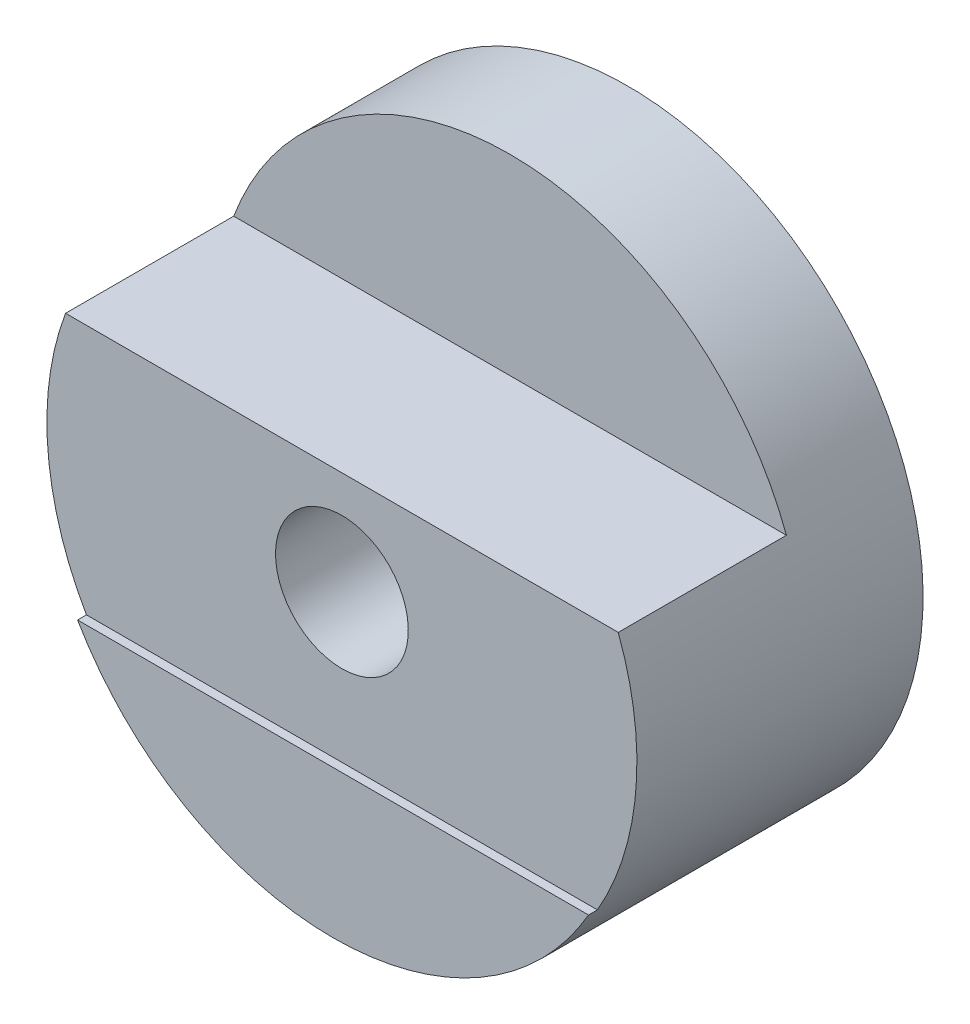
ISO-10303-21;
HEADER;
FILE_DESCRIPTION(('STEP AP214'),'2;1');
FILE_NAME('part.step','',(''),(''),'','','');
FILE_SCHEMA(('AUTOMOTIVE_DESIGN { 1 0 10303 214 1 1 1 1 }'));
ENDSEC;
DATA;
#1=APPLICATION_CONTEXT('core data for automotive mechanical design processes');
#2=APPLICATION_PROTOCOL_DEFINITION('international standard','automotive_design',2000,#1);
#3=PRODUCT_CONTEXT('',#1,'mechanical');
#4=PRODUCT('Part','Part','',(#3));
#5=PRODUCT_RELATED_PRODUCT_CATEGORY('part','',(#4));
#6=PRODUCT_DEFINITION_FORMATION('','',#4);
#7=PRODUCT_DEFINITION_CONTEXT('part definition',#1,'design');
#8=PRODUCT_DEFINITION('design','',#6,#7);
#9=PRODUCT_DEFINITION_SHAPE('','',#8);
#10=(LENGTH_UNIT() NAMED_UNIT(*) SI_UNIT(.MILLI.,.METRE.));
#11=(NAMED_UNIT(*) PLANE_ANGLE_UNIT() SI_UNIT($,.RADIAN.));
#12=(NAMED_UNIT(*) SI_UNIT($,.STERADIAN.) SOLID_ANGLE_UNIT());
#13=UNCERTAINTY_MEASURE_WITH_UNIT(LENGTH_MEASURE(1.E-05),#10,'distance_accuracy_value','');
#14=(GEOMETRIC_REPRESENTATION_CONTEXT(3) GLOBAL_UNCERTAINTY_ASSIGNED_CONTEXT((#13)) GLOBAL_UNIT_ASSIGNED_CONTEXT((#10,
#11,#12)) REPRESENTATION_CONTEXT('',''));
#15=CARTESIAN_POINT('',(0.,0.,0.));
#16=DIRECTION('',(0.,0.,1.));
#17=DIRECTION('',(1.,0.,0.));
#18=AXIS2_PLACEMENT_3D('',#15,#16,#17);
#19=CARTESIAN_POINT('',(0.,0.,-10.));
#20=DIRECTION('',(0.,0.,1.));
#21=DIRECTION('',(0.,-1.,0.));
#22=AXIS2_PLACEMENT_3D('',#19,#20,#21);
#23=CYLINDRICAL_SURFACE('',#22,2.25);
#24=CARTESIAN_POINT('',(0.,0.,-0.3));
#25=DIRECTION('',(0.,0.,1.));
#26=DIRECTION('',(0.,-1.,0.));
#27=AXIS2_PLACEMENT_3D('',#24,#25,#26);
#28=CIRCLE('',#27,2.25);
#29=CARTESIAN_POINT('',(0.,-2.25,-0.300000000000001));
#30=VERTEX_POINT('',#29);
#31=EDGE_CURVE('E83',#30,#30,#28,.T.);
#32=ORIENTED_EDGE('',*,*,#31,.T.);
#33=EDGE_LOOP('',(#32));
#34=FACE_BOUND('',#33,.T.);
#35=CARTESIAN_POINT('',(0.,0.,-10.));
#36=DIRECTION('',(0.,0.,1.));
#37=DIRECTION('',(0.,-1.,0.));
#38=AXIS2_PLACEMENT_3D('',#35,#36,#37);
#39=CIRCLE('',#38,2.25);
#40=CARTESIAN_POINT('',(0.,-2.25,-10.));
#41=VERTEX_POINT('',#40);
#42=EDGE_CURVE('E69',#41,#41,#39,.T.);
#43=ORIENTED_EDGE('',*,*,#42,.F.);
#44=EDGE_LOOP('',(#43));
#45=FACE_BOUND('',#44,.T.);
#46=ADVANCED_FACE('F17',(#34,#45),#23,.F.);
#47=CARTESIAN_POINT('',(9.36749699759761,3.5,-6.));
#48=DIRECTION('',(0.,0.,-1.));
#49=DIRECTION('',(-1.,0.,0.));
#50=AXIS2_PLACEMENT_3D('',#47,#48,#49);
#51=PLANE('',#50);
#52=CARTESIAN_POINT('',(0.,0.,-6.));
#53=DIRECTION('',(0.,0.,1.));
#54=DIRECTION('',(0.,-1.,0.));
#55=AXIS2_PLACEMENT_3D('',#52,#53,#54);
#56=CIRCLE('',#55,10.);
#57=CARTESIAN_POINT('',(9.3674969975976,3.5,-6.00000000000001));
#58=VERTEX_POINT('',#57);
#59=CARTESIAN_POINT('',(-9.36749699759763,3.49999999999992,-6.));
#60=VERTEX_POINT('',#59);
#61=EDGE_CURVE('E55',#58,#60,#56,.T.);
#62=ORIENTED_EDGE('',*,*,#61,.T.);
#63=DIRECTION('',(1.,0.,0.));
#64=VECTOR('',#63,1.);
#65=CARTESIAN_POINT('',(0.,3.5,-6.00000000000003));
#66=LINE('',#65,#64);
#67=EDGE_CURVE('E58',#60,#58,#66,.T.);
#68=ORIENTED_EDGE('',*,*,#67,.T.);
#69=EDGE_LOOP('',(#62,#68));
#70=FACE_BOUND('',#69,.T.);
#71=ADVANCED_FACE('F57',(#70),#51,.F.);
#72=CARTESIAN_POINT('',(-9.36749699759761,3.5,-0.3));
#73=DIRECTION('',(0.,-1.,0.));
#74=DIRECTION('',(0.,0.,-1.));
#75=AXIS2_PLACEMENT_3D('',#72,#73,#74);
#76=PLANE('',#75);
#77=ORIENTED_EDGE('',*,*,#67,.F.);
#78=DIRECTION('',(0.,0.,1.));
#79=VECTOR('',#78,1.);
#80=CARTESIAN_POINT('',(-9.36749699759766,3.49999999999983,-5.));
#81=LINE('',#80,#79);
#82=CARTESIAN_POINT('',(-9.36749699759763,3.49999999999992,-0.3));
#83=VERTEX_POINT('',#82);
#84=EDGE_CURVE('E62',#60,#83,#81,.T.);
#85=ORIENTED_EDGE('',*,*,#84,.T.);
#86=DIRECTION('',(1.,0.,0.));
#87=VECTOR('',#86,1.);
#88=CARTESIAN_POINT('',(-0.508865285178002,3.5,-0.3));
#89=LINE('',#88,#87);
#90=CARTESIAN_POINT('',(9.3674969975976,3.5,-0.3));
#91=VERTEX_POINT('',#90);
#92=EDGE_CURVE('E96',#83,#91,#89,.T.);
#93=ORIENTED_EDGE('',*,*,#92,.T.);
#94=DIRECTION('',(0.,0.,-1.));
#95=VECTOR('',#94,1.);
#96=CARTESIAN_POINT('',(9.3674969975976,3.5,-5.));
#97=LINE('',#96,#95);
#98=EDGE_CURVE('E63',#91,#58,#97,.T.);
#99=ORIENTED_EDGE('',*,*,#98,.T.);
#100=EDGE_LOOP('',(#77,#85,#93,#99));
#101=FACE_BOUND('',#100,.T.);
#102=ADVANCED_FACE('F66',(#101),#76,.F.);
#103=CARTESIAN_POINT('',(10.,-10.,-10.));
#104=DIRECTION('',(0.,0.,-1.));
#105=DIRECTION('',(-1.,0.,0.));
#106=AXIS2_PLACEMENT_3D('',#103,#104,#105);
#107=PLANE('',#106);
#108=ORIENTED_EDGE('',*,*,#42,.T.);
#109=EDGE_LOOP('',(#108));
#110=FACE_BOUND('',#109,.T.);
#111=CARTESIAN_POINT('',(0.,0.,-10.));
#112=DIRECTION('',(0.,0.,1.));
#113=DIRECTION('',(0.,-1.,0.));
#114=AXIS2_PLACEMENT_3D('',#111,#112,#113);
#115=CIRCLE('',#114,10.);
#116=CARTESIAN_POINT('',(0.,-10.,-10.));
#117=VERTEX_POINT('',#116);
#118=EDGE_CURVE('E86',#117,#117,#115,.F.);
#119=ORIENTED_EDGE('',*,*,#118,.T.);
#120=EDGE_LOOP('',(#119));
#121=FACE_BOUND('',#120,.T.);
#122=ADVANCED_FACE('F123',(#110,#121),#107,.T.);
#123=CARTESIAN_POINT('',(10.,-5.,-0.3));
#124=DIRECTION('',(0.,0.,-1.));
#125=DIRECTION('',(-1.,0.,0.));
#126=AXIS2_PLACEMENT_3D('',#123,#124,#125);
#127=PLANE('',#126);
#128=ORIENTED_EDGE('',*,*,#31,.F.);
#129=EDGE_LOOP('',(#128));
#130=FACE_BOUND('',#129,.T.);
#131=CARTESIAN_POINT('',(0.,0.,-0.3));
#132=DIRECTION('',(0.,0.,1.));
#133=DIRECTION('',(0.,-1.,0.));
#134=AXIS2_PLACEMENT_3D('',#131,#132,#133);
#135=CIRCLE('',#134,10.);
#136=CARTESIAN_POINT('',(8.66025403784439,-5.,-0.300000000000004));
#137=VERTEX_POINT('',#136);
#138=EDGE_CURVE('E76',#137,#91,#135,.T.);
#139=ORIENTED_EDGE('',*,*,#138,.T.);
#140=ORIENTED_EDGE('',*,*,#92,.F.);
#141=CARTESIAN_POINT('',(0.,0.,-0.3));
#142=DIRECTION('',(0.,0.,1.));
#143=DIRECTION('',(0.,-1.,0.));
#144=AXIS2_PLACEMENT_3D('',#141,#142,#143);
#145=CIRCLE('',#144,10.);
#146=CARTESIAN_POINT('',(-8.66025403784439,-5.,-0.300000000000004));
#147=VERTEX_POINT('',#146);
#148=EDGE_CURVE('E74',#83,#147,#145,.T.);
#149=ORIENTED_EDGE('',*,*,#148,.T.);
#150=DIRECTION('',(1.,0.,0.));
#151=VECTOR('',#150,1.);
#152=CARTESIAN_POINT('',(0.,-5.,-0.300000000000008));
#153=LINE('',#152,#151);
#154=EDGE_CURVE('E79',#147,#137,#153,.T.);
#155=ORIENTED_EDGE('',*,*,#154,.T.);
#156=EDGE_LOOP('',(#139,#140,#149,#155));
#157=FACE_BOUND('',#156,.T.);
#158=ADVANCED_FACE('F106',(#130,#157),#127,.F.);
#159=CARTESIAN_POINT('',(0.,0.,-10.));
#160=DIRECTION('',(0.,0.,1.));
#161=DIRECTION('',(0.,-1.,0.));
#162=AXIS2_PLACEMENT_3D('',#159,#160,#161);
#163=CYLINDRICAL_SURFACE('',#162,10.);
#164=ORIENTED_EDGE('',*,*,#118,.F.);
#165=EDGE_LOOP('',(#164));
#166=FACE_BOUND('',#165,.T.);
#167=ORIENTED_EDGE('',*,*,#98,.F.);
#168=ORIENTED_EDGE('',*,*,#138,.F.);
#169=DIRECTION('',(0.,0.,1.));
#170=VECTOR('',#169,1.);
#171=CARTESIAN_POINT('',(8.6602540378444,-5.,-8.6602540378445));
#172=LINE('',#171,#170);
#173=CARTESIAN_POINT('',(8.66025403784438,-5.00000000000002,0.));
#174=VERTEX_POINT('',#173);
#175=EDGE_CURVE('E36',#137,#174,#172,.T.);
#176=ORIENTED_EDGE('',*,*,#175,.T.);
#177=CARTESIAN_POINT('',(0.,0.,0.));
#178=DIRECTION('',(0.,0.,1.));
#179=DIRECTION('',(0.,-1.,0.));
#180=AXIS2_PLACEMENT_3D('',#177,#178,#179);
#181=CIRCLE('',#180,10.);
#182=CARTESIAN_POINT('',(-8.66025403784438,-5.00000000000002,0.));
#183=VERTEX_POINT('',#182);
#184=EDGE_CURVE('E27',#183,#174,#181,.T.);
#185=ORIENTED_EDGE('',*,*,#184,.F.);
#186=DIRECTION('',(0.,0.,-1.));
#187=VECTOR('',#186,1.);
#188=CARTESIAN_POINT('',(-8.6602540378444,-5.,-8.6602540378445));
#189=LINE('',#188,#187);
#190=EDGE_CURVE('E89',#183,#147,#189,.T.);
#191=ORIENTED_EDGE('',*,*,#190,.T.);
#192=ORIENTED_EDGE('',*,*,#148,.F.);
#193=ORIENTED_EDGE('',*,*,#84,.F.);
#194=ORIENTED_EDGE('',*,*,#61,.F.);
#195=EDGE_LOOP('',(#167,#168,#176,#185,#191,#192,#193,#194));
#196=FACE_BOUND('',#195,.T.);
#197=ADVANCED_FACE('F72',(#166,#196),#163,.T.);
#198=CARTESIAN_POINT('',(-8.6602540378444,-5.,0.));
#199=DIRECTION('',(0.,-1.,0.));
#200=DIRECTION('',(0.,0.,-1.));
#201=AXIS2_PLACEMENT_3D('',#198,#199,#200);
#202=PLANE('',#201);
#203=ORIENTED_EDGE('',*,*,#175,.F.);
#204=ORIENTED_EDGE('',*,*,#154,.F.);
#205=ORIENTED_EDGE('',*,*,#190,.F.);
#206=DIRECTION('',(-1.,0.,0.));
#207=VECTOR('',#206,1.);
#208=CARTESIAN_POINT('',(0.,-5.00000000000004,0.));
#209=LINE('',#208,#207);
#210=EDGE_CURVE('E11',#174,#183,#209,.T.);
#211=ORIENTED_EDGE('',*,*,#210,.F.);
#212=EDGE_LOOP('',(#203,#204,#205,#211));
#213=FACE_BOUND('',#212,.T.);
#214=ADVANCED_FACE('F108',(#213),#202,.F.);
#215=CARTESIAN_POINT('',(-8.6602540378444,-20.0000000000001,0.));
#216=DIRECTION('',(0.,0.,1.));
#217=DIRECTION('',(1.,0.,0.));
#218=AXIS2_PLACEMENT_3D('',#215,#216,#217);
#219=PLANE('',#218);
#220=ORIENTED_EDGE('',*,*,#184,.T.);
#221=ORIENTED_EDGE('',*,*,#210,.T.);
#222=EDGE_LOOP('',(#220,#221));
#223=FACE_BOUND('',#222,.T.);
#224=ADVANCED_FACE('F19',(#223),#219,.T.);
#225=CLOSED_SHELL('',(#46,#71,#102,#122,#158,#197,#214,#224));
#226=MANIFOLD_SOLID_BREP('B1',#225);
#227=ADVANCED_BREP_SHAPE_REPRESENTATION('',(#18,#226),#14);
#228=SHAPE_DEFINITION_REPRESENTATION(#9,#227);
ENDSEC;
END-ISO-10303-21;
